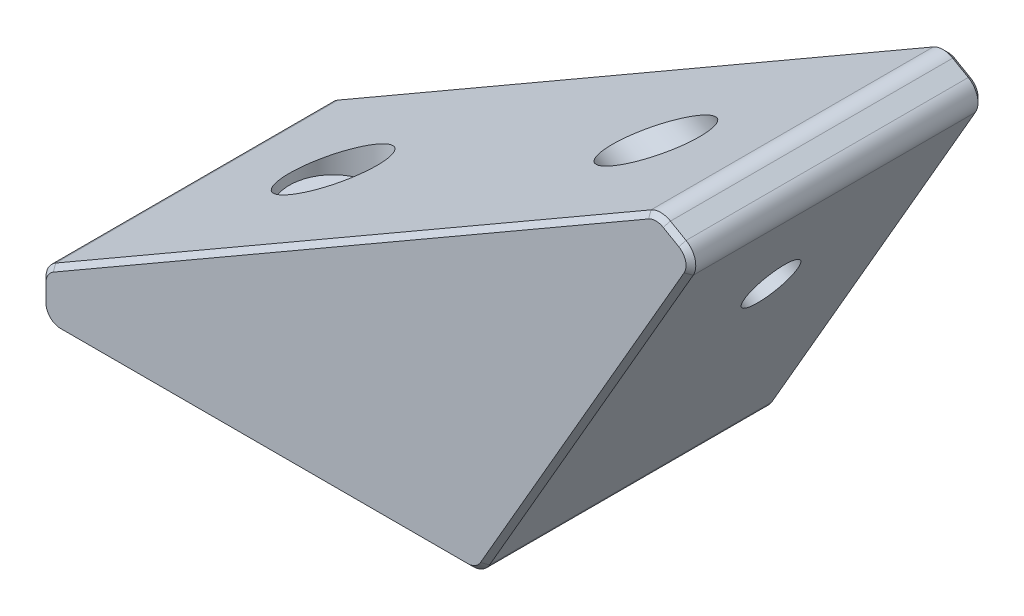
ISO-10303-21;
HEADER;
FILE_DESCRIPTION(('STEP AP214'),'2;1');
FILE_NAME('part.step','',(''),(''),'','','');
FILE_SCHEMA(('AUTOMOTIVE_DESIGN { 1 0 10303 214 1 1 1 1 }'));
ENDSEC;
DATA;
#1=APPLICATION_CONTEXT('core data for automotive mechanical design processes');
#2=APPLICATION_PROTOCOL_DEFINITION('international standard','automotive_design',2000,#1);
#3=PRODUCT_CONTEXT('',#1,'mechanical');
#4=PRODUCT('Part','Part','',(#3));
#5=PRODUCT_RELATED_PRODUCT_CATEGORY('part','',(#4));
#6=PRODUCT_DEFINITION_FORMATION('','',#4);
#7=PRODUCT_DEFINITION_CONTEXT('part definition',#1,'design');
#8=PRODUCT_DEFINITION('design','',#6,#7);
#9=PRODUCT_DEFINITION_SHAPE('','',#8);
#10=(LENGTH_UNIT() NAMED_UNIT(*) SI_UNIT(.MILLI.,.METRE.));
#11=(NAMED_UNIT(*) PLANE_ANGLE_UNIT() SI_UNIT($,.RADIAN.));
#12=(NAMED_UNIT(*) SI_UNIT($,.STERADIAN.) SOLID_ANGLE_UNIT());
#13=UNCERTAINTY_MEASURE_WITH_UNIT(LENGTH_MEASURE(1.E-05),#10,'distance_accuracy_value','');
#14=(GEOMETRIC_REPRESENTATION_CONTEXT(3) GLOBAL_UNCERTAINTY_ASSIGNED_CONTEXT((#13)) GLOBAL_UNIT_ASSIGNED_CONTEXT((#10,
#11,#12)) REPRESENTATION_CONTEXT('',''));
#15=CARTESIAN_POINT('',(0.,0.,0.));
#16=DIRECTION('',(0.,0.,1.));
#17=DIRECTION('',(1.,0.,0.));
#18=AXIS2_PLACEMENT_3D('',#15,#16,#17);
#19=CARTESIAN_POINT('',(45.,0.,30.));
#20=DIRECTION('',(0.,1.,0.));
#21=DIRECTION('',(-1.,0.,0.));
#22=AXIS2_PLACEMENT_3D('',#19,#20,#21);
#23=PLANE('',#22);
#24=CARTESIAN_POINT('',(15.,0.,15.));
#25=DIRECTION('',(0.,-1.,0.));
#26=DIRECTION('',(0.,0.,-1.));
#27=AXIS2_PLACEMENT_3D('',#24,#25,#26);
#28=CIRCLE('',#27,2.74999999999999);
#29=CARTESIAN_POINT('',(15.,0.,12.25));
#30=VERTEX_POINT('',#29);
#31=EDGE_CURVE('E416',#30,#30,#28,.T.);
#32=ORIENTED_EDGE('',*,*,#31,.F.);
#33=EDGE_LOOP('',(#32));
#34=FACE_BOUND('',#33,.T.);
#35=DIRECTION('',(0.,0.,-1.));
#36=VECTOR('',#35,1.);
#37=CARTESIAN_POINT('',(2.,0.,30.));
#38=LINE('',#37,#36);
#39=CARTESIAN_POINT('',(2.,0.,29.5));
#40=VERTEX_POINT('',#39);
#41=CARTESIAN_POINT('',(2.,0.,0.5));
#42=VERTEX_POINT('',#41);
#43=EDGE_CURVE('E396',#40,#42,#38,.T.);
#44=ORIENTED_EDGE('',*,*,#43,.T.);
#45=DIRECTION('',(1.,0.,0.));
#46=VECTOR('',#45,1.);
#47=CARTESIAN_POINT('',(43.8452994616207,0.,0.5));
#48=LINE('',#47,#46);
#49=CARTESIAN_POINT('',(43.8452994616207,0.,0.5));
#50=VERTEX_POINT('',#49);
#51=EDGE_CURVE('E245',#42,#50,#48,.T.);
#52=ORIENTED_EDGE('',*,*,#51,.T.);
#53=DIRECTION('',(0.,0.,-1.));
#54=VECTOR('',#53,1.);
#55=CARTESIAN_POINT('',(43.8452994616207,0.,30.));
#56=LINE('',#55,#54);
#57=CARTESIAN_POINT('',(43.8452994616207,0.,29.5));
#58=VERTEX_POINT('',#57);
#59=EDGE_CURVE('E392',#50,#58,#56,.F.);
#60=ORIENTED_EDGE('',*,*,#59,.T.);
#61=DIRECTION('',(-1.,0.,0.));
#62=VECTOR('',#61,1.);
#63=CARTESIAN_POINT('',(45.,0.,29.5));
#64=LINE('',#63,#62);
#65=EDGE_CURVE('E243',#58,#40,#64,.T.);
#66=ORIENTED_EDGE('',*,*,#65,.T.);
#67=EDGE_LOOP('',(#44,#52,#60,#66));
#68=FACE_BOUND('',#67,.T.);
#69=ADVANCED_FACE('F40',(#34,#68),#23,.F.);
#70=CARTESIAN_POINT('',(67.4999999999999,38.9711431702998,30.));
#71=DIRECTION('',(-0.86602540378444,0.499999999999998,0.));
#72=DIRECTION('',(-0.499999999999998,-0.86602540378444,0.));
#73=AXIS2_PLACEMENT_3D('',#70,#71,#72);
#74=PLANE('',#73);
#75=CARTESIAN_POINT('',(59.9999999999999,25.9807621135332,15.));
#76=DIRECTION('',(0.86602540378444,-0.499999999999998,0.));
#77=DIRECTION('',(0.499999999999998,0.86602540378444,0.));
#78=AXIS2_PLACEMENT_3D('',#75,#76,#77);
#79=CIRCLE('',#78,2.75);
#80=CARTESIAN_POINT('',(61.3749999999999,28.3623319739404,15.));
#81=VERTEX_POINT('',#80);
#82=EDGE_CURVE('E405',#81,#81,#79,.T.);
#83=ORIENTED_EDGE('',*,*,#82,.F.);
#84=EDGE_LOOP('',(#83));
#85=FACE_BOUND('',#84,.T.);
#86=DIRECTION('',(0.,0.,-1.));
#87=VECTOR('',#86,1.);
#88=CARTESIAN_POINT('',(45.5773502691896,1.,30.));
#89=LINE('',#88,#87);
#90=CARTESIAN_POINT('',(45.5773502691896,1.,29.5));
#91=VERTEX_POINT('',#90);
#92=CARTESIAN_POINT('',(45.5773502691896,1.,0.5));
#93=VERTEX_POINT('',#92);
#94=EDGE_CURVE('E399',#91,#93,#89,.T.);
#95=ORIENTED_EDGE('',*,*,#94,.T.);
#96=DIRECTION('',(0.499999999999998,0.86602540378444,0.));
#97=VECTOR('',#96,1.);
#98=CARTESIAN_POINT('',(66.4999999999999,37.2390923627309,0.5));
#99=LINE('',#98,#97);
#100=CARTESIAN_POINT('',(66.4999999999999,37.2390923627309,0.5));
#101=VERTEX_POINT('',#100);
#102=EDGE_CURVE('E255',#93,#101,#99,.T.);
#103=ORIENTED_EDGE('',*,*,#102,.T.);
#104=DIRECTION('',(0.,0.,-1.));
#105=VECTOR('',#104,1.);
#106=CARTESIAN_POINT('',(66.4999999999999,37.2390923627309,30.));
#107=LINE('',#106,#105);
#108=CARTESIAN_POINT('',(66.4999999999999,37.2390923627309,29.5));
#109=VERTEX_POINT('',#108);
#110=EDGE_CURVE('E403',#101,#109,#107,.F.);
#111=ORIENTED_EDGE('',*,*,#110,.T.);
#112=DIRECTION('',(-0.499999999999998,-0.86602540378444,0.));
#113=VECTOR('',#112,1.);
#114=CARTESIAN_POINT('',(67.4999999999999,38.9711431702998,29.5));
#115=LINE('',#114,#113);
#116=EDGE_CURVE('E253',#109,#91,#115,.T.);
#117=ORIENTED_EDGE('',*,*,#116,.T.);
#118=EDGE_LOOP('',(#95,#103,#111,#117));
#119=FACE_BOUND('',#118,.T.);
#120=ADVANCED_FACE('F449',(#85,#119),#74,.F.);
#121=CARTESIAN_POINT('',(63.1698729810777,41.4711431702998,30.));
#122=DIRECTION('',(-0.499999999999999,-0.866025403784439,0.));
#123=DIRECTION('',(0.866025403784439,-0.499999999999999,0.));
#124=AXIS2_PLACEMENT_3D('',#121,#122,#123);
#125=PLANE('',#124);
#126=DIRECTION('',(0.,0.,-1.));
#127=VECTOR('',#126,1.);
#128=CARTESIAN_POINT('',(65.767949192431,39.9711431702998,30.));
#129=LINE('',#128,#127);
#130=CARTESIAN_POINT('',(65.767949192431,39.9711431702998,29.5));
#131=VERTEX_POINT('',#130);
#132=CARTESIAN_POINT('',(65.767949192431,39.9711431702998,0.5));
#133=VERTEX_POINT('',#132);
#134=EDGE_CURVE('E342',#131,#133,#129,.T.);
#135=ORIENTED_EDGE('',*,*,#134,.T.);
#136=DIRECTION('',(-0.866025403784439,0.499999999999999,0.));
#137=VECTOR('',#136,1.);
#138=CARTESIAN_POINT('',(64.1698729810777,40.8937929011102,0.5));
#139=LINE('',#138,#137);
#140=CARTESIAN_POINT('',(64.1698729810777,40.8937929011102,0.5));
#141=VERTEX_POINT('',#140);
#142=EDGE_CURVE('E219',#133,#141,#139,.T.);
#143=ORIENTED_EDGE('',*,*,#142,.T.);
#144=DIRECTION('',(0.,0.,-1.));
#145=VECTOR('',#144,1.);
#146=CARTESIAN_POINT('',(64.1698729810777,40.8937929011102,30.));
#147=LINE('',#146,#145);
#148=CARTESIAN_POINT('',(64.1698729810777,40.8937929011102,29.5));
#149=VERTEX_POINT('',#148);
#150=EDGE_CURVE('E203',#141,#149,#147,.F.);
#151=ORIENTED_EDGE('',*,*,#150,.T.);
#152=DIRECTION('',(0.866025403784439,-0.499999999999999,0.));
#153=VECTOR('',#152,1.);
#154=CARTESIAN_POINT('',(63.1698729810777,41.4711431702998,29.5));
#155=LINE('',#154,#153);
#156=EDGE_CURVE('E217',#149,#131,#155,.T.);
#157=ORIENTED_EDGE('',*,*,#156,.T.);
#158=EDGE_LOOP('',(#135,#143,#151,#157));
#159=FACE_BOUND('',#158,.T.);
#160=ADVANCED_FACE('F341',(#159),#125,.F.);
#161=CARTESIAN_POINT('',(0.,5.,30.));
#162=DIRECTION('',(0.500000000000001,-0.866025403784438,0.));
#163=DIRECTION('',(0.866025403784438,0.500000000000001,0.));
#164=AXIS2_PLACEMENT_3D('',#161,#162,#163);
#165=PLANE('',#164);
#166=CARTESIAN_POINT('',(15.,13.6602540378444,15.));
#167=DIRECTION('',(0.500000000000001,-0.866025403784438,0.));
#168=DIRECTION('',(-0.866025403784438,-0.500000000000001,0.));
#169=AXIS2_PLACEMENT_3D('',#166,#167,#168);
#170=ELLIPSE('',#169,5.19615242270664,4.5);
#171=CARTESIAN_POINT('',(10.5,11.0621778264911,15.));
#172=VERTEX_POINT('',#171);
#173=EDGE_CURVE('E406',#172,#172,#170,.T.);
#174=ORIENTED_EDGE('',*,*,#173,.T.);
#175=EDGE_LOOP('',(#174));
#176=FACE_BOUND('',#175,.T.);
#177=CARTESIAN_POINT('',(48.1698729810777,32.8108891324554,15.));
#178=DIRECTION('',(0.500000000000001,-0.866025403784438,0.));
#179=DIRECTION('',(0.866025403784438,0.500000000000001,0.));
#180=AXIS2_PLACEMENT_3D('',#177,#178,#179);
#181=ELLIPSE('',#180,5.19615242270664,4.5);
#182=CARTESIAN_POINT('',(52.6698729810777,35.4089653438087,15.));
#183=VERTEX_POINT('',#182);
#184=EDGE_CURVE('E413',#183,#183,#181,.T.);
#185=ORIENTED_EDGE('',*,*,#184,.T.);
#186=EDGE_LOOP('',(#185));
#187=FACE_BOUND('',#186,.T.);
#188=DIRECTION('',(0.,0.,-1.));
#189=VECTOR('',#188,1.);
#190=CARTESIAN_POINT('',(62.1698729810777,40.8937929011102,30.));
#191=LINE('',#190,#189);
#192=CARTESIAN_POINT('',(62.1698729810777,40.8937929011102,29.5));
#193=VERTEX_POINT('',#192);
#194=CARTESIAN_POINT('',(62.1698729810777,40.8937929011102,0.5));
#195=VERTEX_POINT('',#194);
#196=EDGE_CURVE('E352',#193,#195,#191,.T.);
#197=ORIENTED_EDGE('',*,*,#196,.T.);
#198=DIRECTION('',(-0.866025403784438,-0.500000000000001,0.));
#199=VECTOR('',#198,1.);
#200=CARTESIAN_POINT('',(0.999999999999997,5.57735026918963,0.5));
#201=LINE('',#200,#199);
#202=CARTESIAN_POINT('',(0.999999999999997,5.57735026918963,0.5));
#203=VERTEX_POINT('',#202);
#204=EDGE_CURVE('E227',#195,#203,#201,.T.);
#205=ORIENTED_EDGE('',*,*,#204,.T.);
#206=DIRECTION('',(0.,0.,-1.));
#207=VECTOR('',#206,1.);
#208=CARTESIAN_POINT('',(0.999999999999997,5.57735026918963,30.));
#209=LINE('',#208,#207);
#210=CARTESIAN_POINT('',(0.999999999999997,5.57735026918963,29.5));
#211=VERTEX_POINT('',#210);
#212=EDGE_CURVE('E348',#203,#211,#209,.F.);
#213=ORIENTED_EDGE('',*,*,#212,.T.);
#214=DIRECTION('',(0.866025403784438,0.500000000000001,0.));
#215=VECTOR('',#214,1.);
#216=CARTESIAN_POINT('',(0.,5.,29.5));
#217=LINE('',#216,#215);
#218=EDGE_CURVE('E225',#211,#193,#217,.T.);
#219=ORIENTED_EDGE('',*,*,#218,.T.);
#220=EDGE_LOOP('',(#197,#205,#213,#219));
#221=FACE_BOUND('',#220,.T.);
#222=ADVANCED_FACE('F510',(#176,#187,#221),#165,.F.);
#223=CARTESIAN_POINT('',(0.,0.,30.));
#224=DIRECTION('',(1.,0.,0.));
#225=DIRECTION('',(0.,0.,-1.));
#226=AXIS2_PLACEMENT_3D('',#223,#224,#225);
#227=PLANE('',#226);
#228=DIRECTION('',(0.,0.,-1.));
#229=VECTOR('',#228,1.);
#230=CARTESIAN_POINT('',(0.,3.84529946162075,30.));
#231=LINE('',#230,#229);
#232=CARTESIAN_POINT('',(0.,3.84529946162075,29.5));
#233=VERTEX_POINT('',#232);
#234=CARTESIAN_POINT('',(0.,3.84529946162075,0.5));
#235=VERTEX_POINT('',#234);
#236=EDGE_CURVE('E387',#233,#235,#231,.T.);
#237=ORIENTED_EDGE('',*,*,#236,.T.);
#238=DIRECTION('',(0.,-1.,0.));
#239=VECTOR('',#238,1.);
#240=CARTESIAN_POINT('',(0.,2.,0.5));
#241=LINE('',#240,#239);
#242=CARTESIAN_POINT('',(0.,2.,0.5));
#243=VERTEX_POINT('',#242);
#244=EDGE_CURVE('E236',#235,#243,#241,.T.);
#245=ORIENTED_EDGE('',*,*,#244,.T.);
#246=DIRECTION('',(0.,0.,-1.));
#247=VECTOR('',#246,1.);
#248=CARTESIAN_POINT('',(0.,2.,30.));
#249=LINE('',#248,#247);
#250=CARTESIAN_POINT('',(0.,2.,29.5));
#251=VERTEX_POINT('',#250);
#252=EDGE_CURVE('E385',#243,#251,#249,.F.);
#253=ORIENTED_EDGE('',*,*,#252,.T.);
#254=DIRECTION('',(0.,1.,0.));
#255=VECTOR('',#254,1.);
#256=CARTESIAN_POINT('',(0.,0.,29.5));
#257=LINE('',#256,#255);
#258=EDGE_CURVE('E234',#251,#233,#257,.T.);
#259=ORIENTED_EDGE('',*,*,#258,.T.);
#260=EDGE_LOOP('',(#237,#245,#253,#259));
#261=FACE_BOUND('',#260,.T.);
#262=ADVANCED_FACE('F495',(#261),#227,.F.);
#263=CARTESIAN_POINT('',(0.,0.,30.));
#264=DIRECTION('',(0.,0.,-1.));
#265=DIRECTION('',(-1.,0.,0.));
#266=AXIS2_PLACEMENT_3D('',#263,#264,#265);
#267=PLANE('',#266);
#268=DIRECTION('',(0.,-1.,0.));
#269=VECTOR('',#268,1.);
#270=CARTESIAN_POINT('',(0.499999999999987,0.,30.));
#271=LINE('',#270,#269);
#272=CARTESIAN_POINT('',(0.499999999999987,3.84529946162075,30.));
#273=VERTEX_POINT('',#272);
#274=CARTESIAN_POINT('',(0.499999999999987,2.,30.));
#275=VERTEX_POINT('',#274);
#276=EDGE_CURVE('E50',#273,#275,#271,.T.);
#277=ORIENTED_EDGE('',*,*,#276,.T.);
#278=CARTESIAN_POINT('',(2.,2.,30.));
#279=DIRECTION('',(0.,0.,-1.));
#280=DIRECTION('',(-1.,0.,0.));
#281=AXIS2_PLACEMENT_3D('',#278,#279,#280);
#282=CIRCLE('',#281,1.50000000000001);
#283=CARTESIAN_POINT('',(2.,0.499999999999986,30.));
#284=VERTEX_POINT('',#283);
#285=EDGE_CURVE('E11',#275,#284,#282,.F.);
#286=ORIENTED_EDGE('',*,*,#285,.T.);
#287=DIRECTION('',(1.,0.,0.));
#288=VECTOR('',#287,1.);
#289=CARTESIAN_POINT('',(0.,0.499999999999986,30.));
#290=LINE('',#289,#288);
#291=CARTESIAN_POINT('',(43.8452994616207,0.499999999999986,30.));
#292=VERTEX_POINT('',#291);
#293=EDGE_CURVE('E258',#284,#292,#290,.T.);
#294=ORIENTED_EDGE('',*,*,#293,.T.);
#295=CARTESIAN_POINT('',(43.8452994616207,2.,30.));
#296=DIRECTION('',(0.,0.,-1.));
#297=DIRECTION('',(-1.,0.,0.));
#298=AXIS2_PLACEMENT_3D('',#295,#296,#297);
#299=CIRCLE('',#298,1.50000000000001);
#300=CARTESIAN_POINT('',(45.1443375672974,1.24999999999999,30.));
#301=VERTEX_POINT('',#300);
#302=EDGE_CURVE('E260',#292,#301,#299,.F.);
#303=ORIENTED_EDGE('',*,*,#302,.T.);
#304=DIRECTION('',(0.499999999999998,0.86602540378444,0.));
#305=VECTOR('',#304,1.);
#306=CARTESIAN_POINT('',(33.3169872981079,-19.2355715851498,30.));
#307=LINE('',#306,#305);
#308=CARTESIAN_POINT('',(66.0669872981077,37.4890923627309,30.));
#309=VERTEX_POINT('',#308);
#310=EDGE_CURVE('E262',#301,#309,#307,.T.);
#311=ORIENTED_EDGE('',*,*,#310,.T.);
#312=CARTESIAN_POINT('',(64.767949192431,38.2390923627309,30.));
#313=DIRECTION('',(0.,0.,-1.));
#314=DIRECTION('',(-1.,0.,0.));
#315=AXIS2_PLACEMENT_3D('',#312,#313,#314);
#316=CIRCLE('',#315,1.50000000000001);
#317=CARTESIAN_POINT('',(65.517949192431,39.5381304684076,30.));
#318=VERTEX_POINT('',#317);
#319=EDGE_CURVE('E264',#309,#318,#316,.F.);
#320=ORIENTED_EDGE('',*,*,#319,.T.);
#321=DIRECTION('',(-0.866025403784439,0.499999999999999,0.));
#322=VECTOR('',#321,1.);
#323=CARTESIAN_POINT('',(33.4999999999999,58.0237020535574,30.));
#324=LINE('',#323,#322);
#325=CARTESIAN_POINT('',(63.9198729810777,40.460780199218,30.));
#326=VERTEX_POINT('',#325);
#327=EDGE_CURVE('E266',#318,#326,#324,.T.);
#328=ORIENTED_EDGE('',*,*,#327,.T.);
#329=CARTESIAN_POINT('',(63.1698729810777,39.1617420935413,30.));
#330=DIRECTION('',(0.,0.,-1.));
#331=DIRECTION('',(-1.,0.,0.));
#332=AXIS2_PLACEMENT_3D('',#329,#330,#331);
#333=CIRCLE('',#332,1.50000000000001);
#334=CARTESIAN_POINT('',(62.4198729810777,40.460780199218,30.));
#335=VERTEX_POINT('',#334);
#336=EDGE_CURVE('E268',#326,#335,#333,.F.);
#337=ORIENTED_EDGE('',*,*,#336,.T.);
#338=DIRECTION('',(-0.866025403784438,-0.500000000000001,0.));
#339=VECTOR('',#338,1.);
#340=CARTESIAN_POINT('',(-1.91506350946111,3.31698729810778,30.));
#341=LINE('',#340,#339);
#342=CARTESIAN_POINT('',(1.24999999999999,5.14433756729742,30.));
#343=VERTEX_POINT('',#342);
#344=EDGE_CURVE('E270',#335,#343,#341,.T.);
#345=ORIENTED_EDGE('',*,*,#344,.T.);
#346=CARTESIAN_POINT('',(2.,3.84529946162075,30.));
#347=DIRECTION('',(0.,0.,-1.));
#348=DIRECTION('',(-1.,0.,0.));
#349=AXIS2_PLACEMENT_3D('',#346,#347,#348);
#350=CIRCLE('',#349,1.50000000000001);
#351=EDGE_CURVE('E61',#343,#273,#350,.F.);
#352=ORIENTED_EDGE('',*,*,#351,.T.);
#353=EDGE_LOOP('',(#277,#286,#294,#303,#311,#320,#328,#337,#345,#352));
#354=FACE_BOUND('',#353,.T.);
#355=ADVANCED_FACE('F780',(#354),#267,.F.);
#356=CARTESIAN_POINT('',(0.,0.,0.));
#357=DIRECTION('',(0.,0.,-1.));
#358=DIRECTION('',(-1.,0.,0.));
#359=AXIS2_PLACEMENT_3D('',#356,#357,#358);
#360=PLANE('',#359);
#361=DIRECTION('',(0.866025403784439,-0.499999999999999,0.));
#362=VECTOR('',#361,1.);
#363=CARTESIAN_POINT('',(65.517949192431,39.5381304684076,0.));
#364=LINE('',#363,#362);
#365=CARTESIAN_POINT('',(63.9198729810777,40.460780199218,0.));
#366=VERTEX_POINT('',#365);
#367=CARTESIAN_POINT('',(65.517949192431,39.5381304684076,0.));
#368=VERTEX_POINT('',#367);
#369=EDGE_CURVE('E207',#366,#368,#364,.T.);
#370=ORIENTED_EDGE('',*,*,#369,.T.);
#371=CARTESIAN_POINT('',(64.767949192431,38.2390923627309,0.));
#372=DIRECTION('',(0.,0.,-1.));
#373=DIRECTION('',(-1.,0.,0.));
#374=AXIS2_PLACEMENT_3D('',#371,#372,#373);
#375=CIRCLE('',#374,1.49999999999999);
#376=CARTESIAN_POINT('',(66.0669872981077,37.4890923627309,0.));
#377=VERTEX_POINT('',#376);
#378=EDGE_CURVE('E187',#368,#377,#375,.T.);
#379=ORIENTED_EDGE('',*,*,#378,.T.);
#380=DIRECTION('',(-0.499999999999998,-0.86602540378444,0.));
#381=VECTOR('',#380,1.);
#382=CARTESIAN_POINT('',(45.1443375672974,1.25000000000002,0.));
#383=LINE('',#382,#381);
#384=CARTESIAN_POINT('',(45.1443375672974,1.25,0.));
#385=VERTEX_POINT('',#384);
#386=EDGE_CURVE('E195',#377,#385,#383,.T.);
#387=ORIENTED_EDGE('',*,*,#386,.T.);
#388=CARTESIAN_POINT('',(43.8452994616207,2.,0.));
#389=DIRECTION('',(0.,0.,-1.));
#390=DIRECTION('',(-1.,0.,0.));
#391=AXIS2_PLACEMENT_3D('',#388,#389,#390);
#392=CIRCLE('',#391,1.5);
#393=CARTESIAN_POINT('',(43.8452994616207,0.500000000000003,0.));
#394=VERTEX_POINT('',#393);
#395=EDGE_CURVE('E202',#385,#394,#392,.T.);
#396=ORIENTED_EDGE('',*,*,#395,.T.);
#397=DIRECTION('',(-1.,0.,0.));
#398=VECTOR('',#397,1.);
#399=CARTESIAN_POINT('',(2.00000000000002,0.500000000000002,0.));
#400=LINE('',#399,#398);
#401=CARTESIAN_POINT('',(2.,0.500000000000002,0.));
#402=VERTEX_POINT('',#401);
#403=EDGE_CURVE('E358',#394,#402,#400,.T.);
#404=ORIENTED_EDGE('',*,*,#403,.T.);
#405=CARTESIAN_POINT('',(2.,2.,0.));
#406=DIRECTION('',(0.,0.,-1.));
#407=DIRECTION('',(-1.,0.,0.));
#408=AXIS2_PLACEMENT_3D('',#405,#406,#407);
#409=CIRCLE('',#408,1.5);
#410=CARTESIAN_POINT('',(0.500000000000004,2.,0.));
#411=VERTEX_POINT('',#410);
#412=EDGE_CURVE('E361',#402,#411,#409,.T.);
#413=ORIENTED_EDGE('',*,*,#412,.T.);
#414=DIRECTION('',(0.,1.,0.));
#415=VECTOR('',#414,1.);
#416=CARTESIAN_POINT('',(0.500000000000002,3.84529946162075,0.));
#417=LINE('',#416,#415);
#418=CARTESIAN_POINT('',(0.500000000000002,3.84529946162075,0.));
#419=VERTEX_POINT('',#418);
#420=EDGE_CURVE('E363',#411,#419,#417,.T.);
#421=ORIENTED_EDGE('',*,*,#420,.T.);
#422=CARTESIAN_POINT('',(2.,3.84529946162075,0.));
#423=DIRECTION('',(0.,0.,-1.));
#424=DIRECTION('',(-1.,0.,0.));
#425=AXIS2_PLACEMENT_3D('',#422,#423,#424);
#426=CIRCLE('',#425,1.5);
#427=CARTESIAN_POINT('',(1.25,5.14433756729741,0.));
#428=VERTEX_POINT('',#427);
#429=EDGE_CURVE('E365',#419,#428,#426,.T.);
#430=ORIENTED_EDGE('',*,*,#429,.T.);
#431=DIRECTION('',(0.866025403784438,0.500000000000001,0.));
#432=VECTOR('',#431,1.);
#433=CARTESIAN_POINT('',(62.4198729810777,40.460780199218,0.));
#434=LINE('',#433,#432);
#435=CARTESIAN_POINT('',(62.4198729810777,40.460780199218,0.));
#436=VERTEX_POINT('',#435);
#437=EDGE_CURVE('E367',#428,#436,#434,.T.);
#438=ORIENTED_EDGE('',*,*,#437,.T.);
#439=CARTESIAN_POINT('',(63.1698729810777,39.1617420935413,0.));
#440=DIRECTION('',(0.,0.,-1.));
#441=DIRECTION('',(-1.,0.,0.));
#442=AXIS2_PLACEMENT_3D('',#439,#440,#441);
#443=CIRCLE('',#442,1.5);
#444=EDGE_CURVE('E212',#436,#366,#443,.T.);
#445=ORIENTED_EDGE('',*,*,#444,.T.);
#446=EDGE_LOOP('',(#370,#379,#387,#396,#404,#413,#421,#430,#438,#445));
#447=FACE_BOUND('',#446,.T.);
#448=ADVANCED_FACE('F205',(#447),#360,.T.);
#449=CARTESIAN_POINT('',(59.9999999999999,25.9807621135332,15.));
#450=DIRECTION('',(0.86602540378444,-0.499999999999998,0.));
#451=DIRECTION('',(0.499999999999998,0.86602540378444,0.));
#452=AXIS2_PLACEMENT_3D('',#449,#450,#451);
#453=CYLINDRICAL_SURFACE('',#452,2.75);
#454=CARTESIAN_POINT('',(51.3397459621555,30.9807621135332,15.));
#455=DIRECTION('',(0.86602540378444,-0.499999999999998,0.));
#456=DIRECTION('',(0.499999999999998,0.86602540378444,0.));
#457=AXIS2_PLACEMENT_3D('',#454,#455,#456);
#458=CIRCLE('',#457,2.75);
#459=CARTESIAN_POINT('',(52.7147459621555,33.3623319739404,15.));
#460=VERTEX_POINT('',#459);
#461=EDGE_CURVE('E417',#460,#460,#458,.F.);
#462=ORIENTED_EDGE('',*,*,#461,.T.);
#463=EDGE_LOOP('',(#462));
#464=FACE_BOUND('',#463,.T.);
#465=ORIENTED_EDGE('',*,*,#82,.T.);
#466=EDGE_LOOP('',(#465));
#467=FACE_BOUND('',#466,.T.);
#468=ADVANCED_FACE('F443',(#464,#467),#453,.F.);
#469=CARTESIAN_POINT('',(15.,0.,15.));
#470=DIRECTION('',(0.,-1.,0.));
#471=DIRECTION('',(0.,0.,-1.));
#472=AXIS2_PLACEMENT_3D('',#469,#470,#471);
#473=CYLINDRICAL_SURFACE('',#472,2.74999999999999);
#474=CARTESIAN_POINT('',(15.,10.,15.));
#475=DIRECTION('',(0.,-1.,0.));
#476=DIRECTION('',(1.,0.,0.));
#477=AXIS2_PLACEMENT_3D('',#474,#475,#476);
#478=CIRCLE('',#477,2.74999999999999);
#479=CARTESIAN_POINT('',(17.75,10.,15.));
#480=VERTEX_POINT('',#479);
#481=EDGE_CURVE('E410',#480,#480,#478,.F.);
#482=ORIENTED_EDGE('',*,*,#481,.T.);
#483=EDGE_LOOP('',(#482));
#484=FACE_BOUND('',#483,.T.);
#485=ORIENTED_EDGE('',*,*,#31,.T.);
#486=EDGE_LOOP('',(#485));
#487=FACE_BOUND('',#486,.T.);
#488=ADVANCED_FACE('F439',(#484,#487),#473,.F.);
#489=CARTESIAN_POINT('',(25.3589838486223,45.9807621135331,15.));
#490=DIRECTION('',(0.86602540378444,-0.499999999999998,0.));
#491=DIRECTION('',(0.499999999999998,0.86602540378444,0.));
#492=AXIS2_PLACEMENT_3D('',#489,#490,#491);
#493=CYLINDRICAL_SURFACE('',#492,4.5);
#494=CARTESIAN_POINT('',(51.3397459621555,30.9807621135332,15.));
#495=DIRECTION('',(0.86602540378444,-0.499999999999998,0.));
#496=DIRECTION('',(0.499999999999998,0.86602540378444,0.));
#497=AXIS2_PLACEMENT_3D('',#494,#495,#496);
#498=CIRCLE('',#497,4.5);
#499=CARTESIAN_POINT('',(53.5897459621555,34.8778764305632,15.));
#500=VERTEX_POINT('',#499);
#501=EDGE_CURVE('E409',#500,#500,#498,.T.);
#502=ORIENTED_EDGE('',*,*,#501,.T.);
#503=EDGE_LOOP('',(#502));
#504=FACE_BOUND('',#503,.T.);
#505=ORIENTED_EDGE('',*,*,#184,.F.);
#506=EDGE_LOOP('',(#505));
#507=FACE_BOUND('',#506,.T.);
#508=ADVANCED_FACE('F442',(#504,#507),#493,.F.);
#509=CARTESIAN_POINT('',(51.3397459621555,30.9807621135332,15.));
#510=DIRECTION('',(0.86602540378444,-0.499999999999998,0.));
#511=DIRECTION('',(0.499999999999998,0.86602540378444,0.));
#512=AXIS2_PLACEMENT_3D('',#509,#510,#511);
#513=PLANE('',#512);
#514=ORIENTED_EDGE('',*,*,#501,.F.);
#515=EDGE_LOOP('',(#514));
#516=FACE_BOUND('',#515,.T.);
#517=ORIENTED_EDGE('',*,*,#461,.F.);
#518=EDGE_LOOP('',(#517));
#519=FACE_BOUND('',#518,.T.);
#520=ADVANCED_FACE('F844',(#516,#519),#513,.F.);
#521=CARTESIAN_POINT('',(15.,40.,15.));
#522=DIRECTION('',(0.,-1.,0.));
#523=DIRECTION('',(1.,0.,0.));
#524=AXIS2_PLACEMENT_3D('',#521,#522,#523);
#525=CYLINDRICAL_SURFACE('',#524,4.5);
#526=CARTESIAN_POINT('',(15.,10.,15.));
#527=DIRECTION('',(0.,-1.,0.));
#528=DIRECTION('',(1.,0.,0.));
#529=AXIS2_PLACEMENT_3D('',#526,#527,#528);
#530=CIRCLE('',#529,4.5);
#531=CARTESIAN_POINT('',(19.5,10.,15.));
#532=VERTEX_POINT('',#531);
#533=EDGE_CURVE('E299',#532,#532,#530,.T.);
#534=ORIENTED_EDGE('',*,*,#533,.T.);
#535=EDGE_LOOP('',(#534));
#536=FACE_BOUND('',#535,.T.);
#537=ORIENTED_EDGE('',*,*,#173,.F.);
#538=EDGE_LOOP('',(#537));
#539=FACE_BOUND('',#538,.T.);
#540=ADVANCED_FACE('F429',(#536,#539),#525,.F.);
#541=CARTESIAN_POINT('',(15.,10.,15.));
#542=DIRECTION('',(0.,-1.,0.));
#543=DIRECTION('',(1.,0.,0.));
#544=AXIS2_PLACEMENT_3D('',#541,#542,#543);
#545=PLANE('',#544);
#546=ORIENTED_EDGE('',*,*,#533,.F.);
#547=EDGE_LOOP('',(#546));
#548=FACE_BOUND('',#547,.T.);
#549=ORIENTED_EDGE('',*,*,#481,.F.);
#550=EDGE_LOOP('',(#549));
#551=FACE_BOUND('',#550,.T.);
#552=ADVANCED_FACE('F432',(#548,#551),#545,.F.);
#553=CARTESIAN_POINT('',(43.8452994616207,2.,30.));
#554=DIRECTION('',(0.,0.,-1.));
#555=DIRECTION('',(-1.,0.,0.));
#556=AXIS2_PLACEMENT_3D('',#553,#554,#555);
#557=CYLINDRICAL_SURFACE('',#556,2.);
#558=ORIENTED_EDGE('',*,*,#59,.F.);
#559=CARTESIAN_POINT('',(43.8452994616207,2.,0.5));
#560=DIRECTION('',(0.,0.,-1.));
#561=DIRECTION('',(-1.,0.,0.));
#562=AXIS2_PLACEMENT_3D('',#559,#560,#561);
#563=CIRCLE('',#562,2.);
#564=EDGE_CURVE('E250',#50,#93,#563,.F.);
#565=ORIENTED_EDGE('',*,*,#564,.T.);
#566=ORIENTED_EDGE('',*,*,#94,.F.);
#567=CARTESIAN_POINT('',(43.8452994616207,2.,29.5));
#568=DIRECTION('',(0.,0.,-1.));
#569=DIRECTION('',(-1.,0.,0.));
#570=AXIS2_PLACEMENT_3D('',#567,#568,#569);
#571=CIRCLE('',#570,2.);
#572=EDGE_CURVE('E248',#91,#58,#571,.T.);
#573=ORIENTED_EDGE('',*,*,#572,.T.);
#574=EDGE_LOOP('',(#558,#565,#566,#573));
#575=FACE_BOUND('',#574,.T.);
#576=ADVANCED_FACE('F435',(#575),#557,.T.);
#577=CARTESIAN_POINT('',(2.,2.,30.));
#578=DIRECTION('',(0.,0.,-1.));
#579=DIRECTION('',(-1.,0.,0.));
#580=AXIS2_PLACEMENT_3D('',#577,#578,#579);
#581=CYLINDRICAL_SURFACE('',#580,2.);
#582=ORIENTED_EDGE('',*,*,#252,.F.);
#583=CARTESIAN_POINT('',(2.,2.,0.5));
#584=DIRECTION('',(0.,0.,-1.));
#585=DIRECTION('',(-1.,0.,0.));
#586=AXIS2_PLACEMENT_3D('',#583,#584,#585);
#587=CIRCLE('',#586,2.);
#588=EDGE_CURVE('E241',#243,#42,#587,.F.);
#589=ORIENTED_EDGE('',*,*,#588,.T.);
#590=ORIENTED_EDGE('',*,*,#43,.F.);
#591=CARTESIAN_POINT('',(2.,2.,29.5));
#592=DIRECTION('',(0.,0.,-1.));
#593=DIRECTION('',(-1.,0.,0.));
#594=AXIS2_PLACEMENT_3D('',#591,#592,#593);
#595=CIRCLE('',#594,2.);
#596=EDGE_CURVE('E238',#40,#251,#595,.T.);
#597=ORIENTED_EDGE('',*,*,#596,.T.);
#598=EDGE_LOOP('',(#582,#589,#590,#597));
#599=FACE_BOUND('',#598,.T.);
#600=ADVANCED_FACE('F492',(#599),#581,.T.);
#601=CARTESIAN_POINT('',(2.,3.84529946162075,30.));
#602=DIRECTION('',(0.,0.,-1.));
#603=DIRECTION('',(-1.,0.,0.));
#604=AXIS2_PLACEMENT_3D('',#601,#602,#603);
#605=CYLINDRICAL_SURFACE('',#604,2.);
#606=ORIENTED_EDGE('',*,*,#212,.F.);
#607=CARTESIAN_POINT('',(2.,3.84529946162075,0.5));
#608=DIRECTION('',(0.,0.,-1.));
#609=DIRECTION('',(-1.,0.,0.));
#610=AXIS2_PLACEMENT_3D('',#607,#608,#609);
#611=CIRCLE('',#610,2.);
#612=EDGE_CURVE('E232',#203,#235,#611,.F.);
#613=ORIENTED_EDGE('',*,*,#612,.T.);
#614=ORIENTED_EDGE('',*,*,#236,.F.);
#615=CARTESIAN_POINT('',(2.,3.84529946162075,29.5));
#616=DIRECTION('',(0.,0.,-1.));
#617=DIRECTION('',(-1.,0.,0.));
#618=AXIS2_PLACEMENT_3D('',#615,#616,#617);
#619=CIRCLE('',#618,2.);
#620=EDGE_CURVE('E230',#233,#211,#619,.T.);
#621=ORIENTED_EDGE('',*,*,#620,.T.);
#622=EDGE_LOOP('',(#606,#613,#614,#621));
#623=FACE_BOUND('',#622,.T.);
#624=ADVANCED_FACE('F513',(#623),#605,.T.);
#625=CARTESIAN_POINT('',(63.1698729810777,39.1617420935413,30.));
#626=DIRECTION('',(0.,0.,-1.));
#627=DIRECTION('',(-1.,0.,0.));
#628=AXIS2_PLACEMENT_3D('',#625,#626,#627);
#629=CYLINDRICAL_SURFACE('',#628,2.);
#630=ORIENTED_EDGE('',*,*,#150,.F.);
#631=CARTESIAN_POINT('',(63.1698729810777,39.1617420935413,0.5));
#632=DIRECTION('',(0.,0.,-1.));
#633=DIRECTION('',(-1.,0.,0.));
#634=AXIS2_PLACEMENT_3D('',#631,#632,#633);
#635=CIRCLE('',#634,2.);
#636=EDGE_CURVE('E223',#141,#195,#635,.F.);
#637=ORIENTED_EDGE('',*,*,#636,.T.);
#638=ORIENTED_EDGE('',*,*,#196,.F.);
#639=CARTESIAN_POINT('',(63.1698729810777,39.1617420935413,29.5));
#640=DIRECTION('',(0.,0.,-1.));
#641=DIRECTION('',(-1.,0.,0.));
#642=AXIS2_PLACEMENT_3D('',#639,#640,#641);
#643=CIRCLE('',#642,2.);
#644=EDGE_CURVE('E221',#193,#149,#643,.T.);
#645=ORIENTED_EDGE('',*,*,#644,.T.);
#646=EDGE_LOOP('',(#630,#637,#638,#645));
#647=FACE_BOUND('',#646,.T.);
#648=ADVANCED_FACE('F380',(#647),#629,.T.);
#649=CARTESIAN_POINT('',(64.767949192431,38.2390923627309,30.));
#650=DIRECTION('',(0.,0.,-1.));
#651=DIRECTION('',(-1.,0.,0.));
#652=AXIS2_PLACEMENT_3D('',#649,#650,#651);
#653=CYLINDRICAL_SURFACE('',#652,2.);
#654=ORIENTED_EDGE('',*,*,#110,.F.);
#655=CARTESIAN_POINT('',(64.767949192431,38.2390923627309,0.5));
#656=DIRECTION('',(0.,0.,-1.));
#657=DIRECTION('',(-1.,0.,0.));
#658=AXIS2_PLACEMENT_3D('',#655,#656,#657);
#659=CIRCLE('',#658,2.);
#660=EDGE_CURVE('E189',#101,#133,#659,.F.);
#661=ORIENTED_EDGE('',*,*,#660,.T.);
#662=ORIENTED_EDGE('',*,*,#134,.F.);
#663=CARTESIAN_POINT('',(64.767949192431,38.2390923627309,29.5));
#664=DIRECTION('',(0.,0.,-1.));
#665=DIRECTION('',(-1.,0.,0.));
#666=AXIS2_PLACEMENT_3D('',#663,#664,#665);
#667=CIRCLE('',#666,2.);
#668=EDGE_CURVE('E209',#131,#109,#667,.T.);
#669=ORIENTED_EDGE('',*,*,#668,.T.);
#670=EDGE_LOOP('',(#654,#661,#662,#669));
#671=FACE_BOUND('',#670,.T.);
#672=ADVANCED_FACE('F346',(#671),#653,.T.);
#673=CARTESIAN_POINT('',(0.,0.,0.5));
#674=DIRECTION('',(-0.707106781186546,0.,-0.707106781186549));
#675=DIRECTION('',(0.,1.,0.));
#676=AXIS2_PLACEMENT_3D('',#673,#674,#675);
#677=PLANE('',#676);
#678=DIRECTION('',(0.707106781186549,0.,-0.707106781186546));
#679=VECTOR('',#678,1.);
#680=CARTESIAN_POINT('',(0.,2.,0.5));
#681=LINE('',#680,#679);
#682=EDGE_CURVE('E293',#243,#411,#681,.T.);
#683=ORIENTED_EDGE('',*,*,#682,.F.);
#684=ORIENTED_EDGE('',*,*,#244,.F.);
#685=DIRECTION('',(-0.707106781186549,0.,0.707106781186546));
#686=VECTOR('',#685,1.);
#687=CARTESIAN_POINT('',(0.500000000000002,3.84529946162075,0.));
#688=LINE('',#687,#686);
#689=EDGE_CURVE('E296',#419,#235,#688,.T.);
#690=ORIENTED_EDGE('',*,*,#689,.F.);
#691=ORIENTED_EDGE('',*,*,#420,.F.);
#692=EDGE_LOOP('',(#683,#684,#690,#691));
#693=FACE_BOUND('',#692,.T.);
#694=ADVANCED_FACE('F500',(#693),#677,.T.);
#695=CARTESIAN_POINT('',(2.,3.84529946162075,0.));
#696=DIRECTION('',(0.,0.,1.));
#697=DIRECTION('',(1.,0.,0.));
#698=AXIS2_PLACEMENT_3D('',#695,#696,#697);
#699=CONICAL_SURFACE('',#698,1.5,0.78539816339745);
#700=ORIENTED_EDGE('',*,*,#689,.T.);
#701=ORIENTED_EDGE('',*,*,#612,.F.);
#702=DIRECTION('',(-0.353553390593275,0.612372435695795,0.707106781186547));
#703=VECTOR('',#702,1.);
#704=CARTESIAN_POINT('',(1.25,5.14433756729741,0.));
#705=LINE('',#704,#703);
#706=EDGE_CURVE('E290',#428,#203,#705,.T.);
#707=ORIENTED_EDGE('',*,*,#706,.F.);
#708=ORIENTED_EDGE('',*,*,#429,.F.);
#709=EDGE_LOOP('',(#700,#701,#707,#708));
#710=FACE_BOUND('',#709,.T.);
#711=ADVANCED_FACE('F505',(#710),#699,.T.);
#712=CARTESIAN_POINT('',(2.,2.,0.));
#713=DIRECTION('',(0.,0.,1.));
#714=DIRECTION('',(1.,0.,0.));
#715=AXIS2_PLACEMENT_3D('',#712,#713,#714);
#716=CONICAL_SURFACE('',#715,1.5,0.78539816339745);
#717=ORIENTED_EDGE('',*,*,#682,.T.);
#718=ORIENTED_EDGE('',*,*,#412,.F.);
#719=DIRECTION('',(0.,0.707106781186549,-0.707106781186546));
#720=VECTOR('',#719,1.);
#721=CARTESIAN_POINT('',(2.,0.,0.5));
#722=LINE('',#721,#720);
#723=EDGE_CURVE('E287',#42,#402,#722,.T.);
#724=ORIENTED_EDGE('',*,*,#723,.F.);
#725=ORIENTED_EDGE('',*,*,#588,.F.);
#726=EDGE_LOOP('',(#717,#718,#724,#725));
#727=FACE_BOUND('',#726,.T.);
#728=ADVANCED_FACE('F461',(#727),#716,.T.);
#729=CARTESIAN_POINT('',(0.,5.,0.5));
#730=DIRECTION('',(-0.353553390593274,0.612372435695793,-0.707106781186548));
#731=DIRECTION('',(0.866025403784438,0.500000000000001,0.));
#732=AXIS2_PLACEMENT_3D('',#729,#730,#731);
#733=PLANE('',#732);
#734=ORIENTED_EDGE('',*,*,#706,.T.);
#735=ORIENTED_EDGE('',*,*,#204,.F.);
#736=DIRECTION('',(-0.353553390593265,0.612372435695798,0.707106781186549));
#737=VECTOR('',#736,1.);
#738=CARTESIAN_POINT('',(62.4198729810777,40.460780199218,0.));
#739=LINE('',#738,#737);
#740=EDGE_CURVE('E284',#436,#195,#739,.T.);
#741=ORIENTED_EDGE('',*,*,#740,.F.);
#742=ORIENTED_EDGE('',*,*,#437,.F.);
#743=EDGE_LOOP('',(#734,#735,#741,#742));
#744=FACE_BOUND('',#743,.T.);
#745=ADVANCED_FACE('F508',(#744),#733,.T.);
#746=CARTESIAN_POINT('',(45.,0.,0.5));
#747=DIRECTION('',(0.,-0.707106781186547,-0.707106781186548));
#748=DIRECTION('',(-1.,0.,0.));
#749=AXIS2_PLACEMENT_3D('',#746,#747,#748);
#750=PLANE('',#749);
#751=ORIENTED_EDGE('',*,*,#723,.T.);
#752=ORIENTED_EDGE('',*,*,#403,.F.);
#753=DIRECTION('',(0.,0.707106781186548,-0.707106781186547));
#754=VECTOR('',#753,1.);
#755=CARTESIAN_POINT('',(43.8452994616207,0.,0.5));
#756=LINE('',#755,#754);
#757=EDGE_CURVE('E280',#50,#394,#756,.T.);
#758=ORIENTED_EDGE('',*,*,#757,.F.);
#759=ORIENTED_EDGE('',*,*,#51,.F.);
#760=EDGE_LOOP('',(#751,#752,#758,#759));
#761=FACE_BOUND('',#760,.T.);
#762=ADVANCED_FACE('F465',(#761),#750,.T.);
#763=CARTESIAN_POINT('',(63.1698729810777,39.1617420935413,0.));
#764=DIRECTION('',(0.,0.,1.));
#765=DIRECTION('',(1.,0.,0.));
#766=AXIS2_PLACEMENT_3D('',#763,#764,#765);
#767=CONICAL_SURFACE('',#766,1.5,0.785398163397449);
#768=ORIENTED_EDGE('',*,*,#740,.T.);
#769=ORIENTED_EDGE('',*,*,#636,.F.);
#770=DIRECTION('',(0.353553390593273,0.612372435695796,0.707106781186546));
#771=VECTOR('',#770,1.);
#772=CARTESIAN_POINT('',(63.9198729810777,40.460780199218,0.));
#773=LINE('',#772,#771);
#774=EDGE_CURVE('E277',#366,#141,#773,.T.);
#775=ORIENTED_EDGE('',*,*,#774,.F.);
#776=ORIENTED_EDGE('',*,*,#444,.F.);
#777=EDGE_LOOP('',(#768,#769,#775,#776));
#778=FACE_BOUND('',#777,.T.);
#779=ADVANCED_FACE('F375',(#778),#767,.T.);
#780=CARTESIAN_POINT('',(43.8452994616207,2.,0.));
#781=DIRECTION('',(0.,0.,1.));
#782=DIRECTION('',(1.,0.,0.));
#783=AXIS2_PLACEMENT_3D('',#780,#781,#782);
#784=CONICAL_SURFACE('',#783,1.5,0.785398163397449);
#785=ORIENTED_EDGE('',*,*,#757,.T.);
#786=ORIENTED_EDGE('',*,*,#395,.F.);
#787=DIRECTION('',(-0.612372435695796,0.353553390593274,-0.707106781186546));
#788=VECTOR('',#787,1.);
#789=CARTESIAN_POINT('',(45.5773502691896,1.,0.500000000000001));
#790=LINE('',#789,#788);
#791=EDGE_CURVE('E198',#93,#385,#790,.T.);
#792=ORIENTED_EDGE('',*,*,#791,.F.);
#793=ORIENTED_EDGE('',*,*,#564,.F.);
#794=EDGE_LOOP('',(#785,#786,#792,#793));
#795=FACE_BOUND('',#794,.T.);
#796=ADVANCED_FACE('F468',(#795),#784,.T.);
#797=CARTESIAN_POINT('',(63.1698729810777,41.4711431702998,0.5));
#798=DIRECTION('',(0.353553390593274,0.612372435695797,-0.707106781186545));
#799=DIRECTION('',(0.866025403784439,-0.499999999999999,0.));
#800=AXIS2_PLACEMENT_3D('',#797,#798,#799);
#801=PLANE('',#800);
#802=ORIENTED_EDGE('',*,*,#774,.T.);
#803=ORIENTED_EDGE('',*,*,#142,.F.);
#804=DIRECTION('',(0.353553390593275,0.61237243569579,0.707106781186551));
#805=VECTOR('',#804,1.);
#806=CARTESIAN_POINT('',(65.517949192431,39.5381304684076,0.));
#807=LINE('',#806,#805);
#808=EDGE_CURVE('E192',#368,#133,#807,.T.);
#809=ORIENTED_EDGE('',*,*,#808,.F.);
#810=ORIENTED_EDGE('',*,*,#369,.F.);
#811=EDGE_LOOP('',(#802,#803,#809,#810));
#812=FACE_BOUND('',#811,.T.);
#813=ADVANCED_FACE('F378',(#812),#801,.T.);
#814=CARTESIAN_POINT('',(67.4999999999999,38.9711431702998,0.5));
#815=DIRECTION('',(0.612372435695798,-0.353553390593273,-0.707106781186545));
#816=DIRECTION('',(-0.499999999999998,-0.86602540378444,0.));
#817=AXIS2_PLACEMENT_3D('',#814,#815,#816);
#818=PLANE('',#817);
#819=ORIENTED_EDGE('',*,*,#791,.T.);
#820=ORIENTED_EDGE('',*,*,#386,.F.);
#821=DIRECTION('',(-0.612372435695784,0.353553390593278,-0.707106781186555));
#822=VECTOR('',#821,1.);
#823=CARTESIAN_POINT('',(66.4999999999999,37.2390923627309,0.5));
#824=LINE('',#823,#822);
#825=EDGE_CURVE('E183',#101,#377,#824,.T.);
#826=ORIENTED_EDGE('',*,*,#825,.F.);
#827=ORIENTED_EDGE('',*,*,#102,.F.);
#828=EDGE_LOOP('',(#819,#820,#826,#827));
#829=FACE_BOUND('',#828,.T.);
#830=ADVANCED_FACE('F196',(#829),#818,.T.);
#831=CARTESIAN_POINT('',(64.767949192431,38.2390923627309,0.));
#832=DIRECTION('',(0.,0.,1.));
#833=DIRECTION('',(1.,0.,0.));
#834=AXIS2_PLACEMENT_3D('',#831,#832,#833);
#835=CONICAL_SURFACE('',#834,1.5,0.785398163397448);
#836=ORIENTED_EDGE('',*,*,#808,.T.);
#837=ORIENTED_EDGE('',*,*,#660,.F.);
#838=ORIENTED_EDGE('',*,*,#825,.T.);
#839=ORIENTED_EDGE('',*,*,#378,.F.);
#840=EDGE_LOOP('',(#836,#837,#838,#839));
#841=FACE_BOUND('',#840,.T.);
#842=ADVANCED_FACE('F185',(#841),#835,.T.);
#843=CARTESIAN_POINT('',(33.4999999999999,58.0237020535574,30.));
#844=DIRECTION('',(-0.353553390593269,-0.612372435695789,-0.707106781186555));
#845=DIRECTION('',(-0.866025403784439,0.499999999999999,0.));
#846=AXIS2_PLACEMENT_3D('',#843,#844,#845);
#847=PLANE('',#846);
#848=DIRECTION('',(-0.353553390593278,-0.612372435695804,0.707106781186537));
#849=VECTOR('',#848,1.);
#850=CARTESIAN_POINT('',(65.767949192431,39.9711431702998,29.5));
#851=LINE('',#850,#849);
#852=EDGE_CURVE('E321',#131,#318,#851,.T.);
#853=ORIENTED_EDGE('',*,*,#852,.F.);
#854=ORIENTED_EDGE('',*,*,#156,.F.);
#855=DIRECTION('',(0.35355339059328,0.612372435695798,-0.707106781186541));
#856=VECTOR('',#855,1.);
#857=CARTESIAN_POINT('',(63.9198729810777,40.460780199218,30.));
#858=LINE('',#857,#856);
#859=EDGE_CURVE('E45',#326,#149,#858,.T.);
#860=ORIENTED_EDGE('',*,*,#859,.F.);
#861=ORIENTED_EDGE('',*,*,#327,.F.);
#862=EDGE_LOOP('',(#853,#854,#860,#861));
#863=FACE_BOUND('',#862,.T.);
#864=ADVANCED_FACE('F43',(#863),#847,.F.);
#865=CARTESIAN_POINT('',(63.1698729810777,39.1617420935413,30.));
#866=DIRECTION('',(0.,0.,-1.));
#867=DIRECTION('',(-1.,0.,0.));
#868=AXIS2_PLACEMENT_3D('',#865,#866,#867);
#869=CONICAL_SURFACE('',#868,1.50000000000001,0.785398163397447);
#870=ORIENTED_EDGE('',*,*,#859,.T.);
#871=ORIENTED_EDGE('',*,*,#644,.F.);
#872=DIRECTION('',(-0.353553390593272,0.612372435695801,-0.707106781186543));
#873=VECTOR('',#872,1.);
#874=CARTESIAN_POINT('',(62.4198729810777,40.460780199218,30.));
#875=LINE('',#874,#873);
#876=EDGE_CURVE('E319',#335,#193,#875,.T.);
#877=ORIENTED_EDGE('',*,*,#876,.F.);
#878=ORIENTED_EDGE('',*,*,#336,.F.);
#879=EDGE_LOOP('',(#870,#871,#877,#878));
#880=FACE_BOUND('',#879,.T.);
#881=ADVANCED_FACE('F332',(#880),#869,.T.);
#882=CARTESIAN_POINT('',(64.767949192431,38.2390923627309,30.));
#883=DIRECTION('',(0.,0.,-1.));
#884=DIRECTION('',(-1.,0.,0.));
#885=AXIS2_PLACEMENT_3D('',#882,#883,#884);
#886=CONICAL_SURFACE('',#885,1.50000000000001,0.785398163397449);
#887=ORIENTED_EDGE('',*,*,#852,.T.);
#888=ORIENTED_EDGE('',*,*,#319,.F.);
#889=DIRECTION('',(-0.612372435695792,0.353553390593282,0.707106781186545));
#890=VECTOR('',#889,1.);
#891=CARTESIAN_POINT('',(66.4999999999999,37.2390923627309,29.5));
#892=LINE('',#891,#890);
#893=EDGE_CURVE('E316',#109,#309,#892,.T.);
#894=ORIENTED_EDGE('',*,*,#893,.F.);
#895=ORIENTED_EDGE('',*,*,#668,.F.);
#896=EDGE_LOOP('',(#887,#888,#894,#895));
#897=FACE_BOUND('',#896,.T.);
#898=ADVANCED_FACE('F554',(#897),#886,.T.);
#899=CARTESIAN_POINT('',(-1.91506350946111,3.31698729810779,30.));
#900=DIRECTION('',(0.353553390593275,-0.612372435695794,-0.707106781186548));
#901=DIRECTION('',(-0.866025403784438,-0.500000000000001,0.));
#902=AXIS2_PLACEMENT_3D('',#899,#900,#901);
#903=PLANE('',#902);
#904=ORIENTED_EDGE('',*,*,#876,.T.);
#905=ORIENTED_EDGE('',*,*,#218,.F.);
#906=DIRECTION('',(-0.353553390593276,0.612372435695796,-0.707106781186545));
#907=VECTOR('',#906,1.);
#908=CARTESIAN_POINT('',(1.24999999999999,5.14433756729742,30.));
#909=LINE('',#908,#907);
#910=EDGE_CURVE('E313',#343,#211,#909,.T.);
#911=ORIENTED_EDGE('',*,*,#910,.F.);
#912=ORIENTED_EDGE('',*,*,#344,.F.);
#913=EDGE_LOOP('',(#904,#905,#911,#912));
#914=FACE_BOUND('',#913,.T.);
#915=ADVANCED_FACE('F548',(#914),#903,.F.);
#916=CARTESIAN_POINT('',(33.3169872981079,-19.2355715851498,30.));
#917=DIRECTION('',(-0.612372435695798,0.353553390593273,-0.707106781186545));
#918=DIRECTION('',(0.499999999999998,0.86602540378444,0.));
#919=AXIS2_PLACEMENT_3D('',#916,#917,#918);
#920=PLANE('',#919);
#921=ORIENTED_EDGE('',*,*,#893,.T.);
#922=ORIENTED_EDGE('',*,*,#310,.F.);
#923=DIRECTION('',(-0.612372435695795,0.353553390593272,0.707106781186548));
#924=VECTOR('',#923,1.);
#925=CARTESIAN_POINT('',(45.5773502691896,1.,29.5));
#926=LINE('',#925,#924);
#927=EDGE_CURVE('E310',#91,#301,#926,.T.);
#928=ORIENTED_EDGE('',*,*,#927,.F.);
#929=ORIENTED_EDGE('',*,*,#116,.F.);
#930=EDGE_LOOP('',(#921,#922,#928,#929));
#931=FACE_BOUND('',#930,.T.);
#932=ADVANCED_FACE('F476',(#931),#920,.F.);
#933=CARTESIAN_POINT('',(2.,3.84529946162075,30.));
#934=DIRECTION('',(0.,0.,-1.));
#935=DIRECTION('',(-1.,0.,0.));
#936=AXIS2_PLACEMENT_3D('',#933,#934,#935);
#937=CONICAL_SURFACE('',#936,1.50000000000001,0.785398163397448);
#938=ORIENTED_EDGE('',*,*,#910,.T.);
#939=ORIENTED_EDGE('',*,*,#620,.F.);
#940=DIRECTION('',(-0.707106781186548,0.,-0.707106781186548));
#941=VECTOR('',#940,1.);
#942=CARTESIAN_POINT('',(0.499999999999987,3.84529946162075,30.));
#943=LINE('',#942,#941);
#944=EDGE_CURVE('E307',#273,#233,#943,.T.);
#945=ORIENTED_EDGE('',*,*,#944,.F.);
#946=ORIENTED_EDGE('',*,*,#351,.F.);
#947=EDGE_LOOP('',(#938,#939,#945,#946));
#948=FACE_BOUND('',#947,.T.);
#949=ADVANCED_FACE('F516',(#948),#937,.T.);
#950=CARTESIAN_POINT('',(43.8452994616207,2.,30.));
#951=DIRECTION('',(0.,0.,-1.));
#952=DIRECTION('',(-1.,0.,0.));
#953=AXIS2_PLACEMENT_3D('',#950,#951,#952);
#954=CONICAL_SURFACE('',#953,1.50000000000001,0.785398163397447);
#955=ORIENTED_EDGE('',*,*,#927,.T.);
#956=ORIENTED_EDGE('',*,*,#302,.F.);
#957=DIRECTION('',(0.,0.707106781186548,0.707106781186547));
#958=VECTOR('',#957,1.);
#959=CARTESIAN_POINT('',(43.8452994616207,0.,29.5));
#960=LINE('',#959,#958);
#961=EDGE_CURVE('E304',#58,#292,#960,.T.);
#962=ORIENTED_EDGE('',*,*,#961,.F.);
#963=ORIENTED_EDGE('',*,*,#572,.F.);
#964=EDGE_LOOP('',(#955,#956,#962,#963));
#965=FACE_BOUND('',#964,.T.);
#966=ADVANCED_FACE('F482',(#965),#954,.T.);
#967=CARTESIAN_POINT('',(0.499999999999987,0.,30.));
#968=DIRECTION('',(0.707106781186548,0.,-0.707106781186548));
#969=DIRECTION('',(0.,-1.,0.));
#970=AXIS2_PLACEMENT_3D('',#967,#968,#969);
#971=PLANE('',#970);
#972=ORIENTED_EDGE('',*,*,#944,.T.);
#973=ORIENTED_EDGE('',*,*,#258,.F.);
#974=DIRECTION('',(-0.707106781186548,0.,-0.707106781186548));
#975=VECTOR('',#974,1.);
#976=CARTESIAN_POINT('',(0.499999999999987,2.,30.));
#977=LINE('',#976,#975);
#978=EDGE_CURVE('E302',#275,#251,#977,.T.);
#979=ORIENTED_EDGE('',*,*,#978,.F.);
#980=ORIENTED_EDGE('',*,*,#276,.F.);
#981=EDGE_LOOP('',(#972,#973,#979,#980));
#982=FACE_BOUND('',#981,.T.);
#983=ADVANCED_FACE('F519',(#982),#971,.F.);
#984=CARTESIAN_POINT('',(0.,0.499999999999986,30.));
#985=DIRECTION('',(0.,0.707106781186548,-0.707106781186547));
#986=DIRECTION('',(1.,0.,0.));
#987=AXIS2_PLACEMENT_3D('',#984,#985,#986);
#988=PLANE('',#987);
#989=ORIENTED_EDGE('',*,*,#961,.T.);
#990=ORIENTED_EDGE('',*,*,#293,.F.);
#991=DIRECTION('',(0.,0.707106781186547,0.707106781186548));
#992=VECTOR('',#991,1.);
#993=CARTESIAN_POINT('',(2.,0.,29.5));
#994=LINE('',#993,#992);
#995=EDGE_CURVE('E300',#40,#284,#994,.T.);
#996=ORIENTED_EDGE('',*,*,#995,.F.);
#997=ORIENTED_EDGE('',*,*,#65,.F.);
#998=EDGE_LOOP('',(#989,#990,#996,#997));
#999=FACE_BOUND('',#998,.T.);
#1000=ADVANCED_FACE('F486',(#999),#988,.F.);
#1001=CARTESIAN_POINT('',(2.,2.,30.));
#1002=DIRECTION('',(0.,0.,-1.));
#1003=DIRECTION('',(-1.,0.,0.));
#1004=AXIS2_PLACEMENT_3D('',#1001,#1002,#1003);
#1005=CONICAL_SURFACE('',#1004,1.50000000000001,0.785398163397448);
#1006=ORIENTED_EDGE('',*,*,#978,.T.);
#1007=ORIENTED_EDGE('',*,*,#596,.F.);
#1008=ORIENTED_EDGE('',*,*,#995,.T.);
#1009=ORIENTED_EDGE('',*,*,#285,.F.);
#1010=EDGE_LOOP('',(#1006,#1007,#1008,#1009));
#1011=FACE_BOUND('',#1010,.T.);
#1012=ADVANCED_FACE('F489',(#1011),#1005,.T.);
#1013=CLOSED_SHELL('',(#69,#120,#160,#222,#262,#355,#448,#468,#488,#508,#520,#540,#552,#576,
#600,#624,#648,#672,#694,#711,#728,#745,#762,#779,#796,#813,#830,#842,#864,#881,#898,#915,#932,
#949,#966,#983,#1000,#1012));
#1014=MANIFOLD_SOLID_BREP('B2',#1013);
#1015=ADVANCED_BREP_SHAPE_REPRESENTATION('',(#18,#1014),#14);
#1016=SHAPE_DEFINITION_REPRESENTATION(#9,#1015);
ENDSEC;
END-ISO-10303-21;
